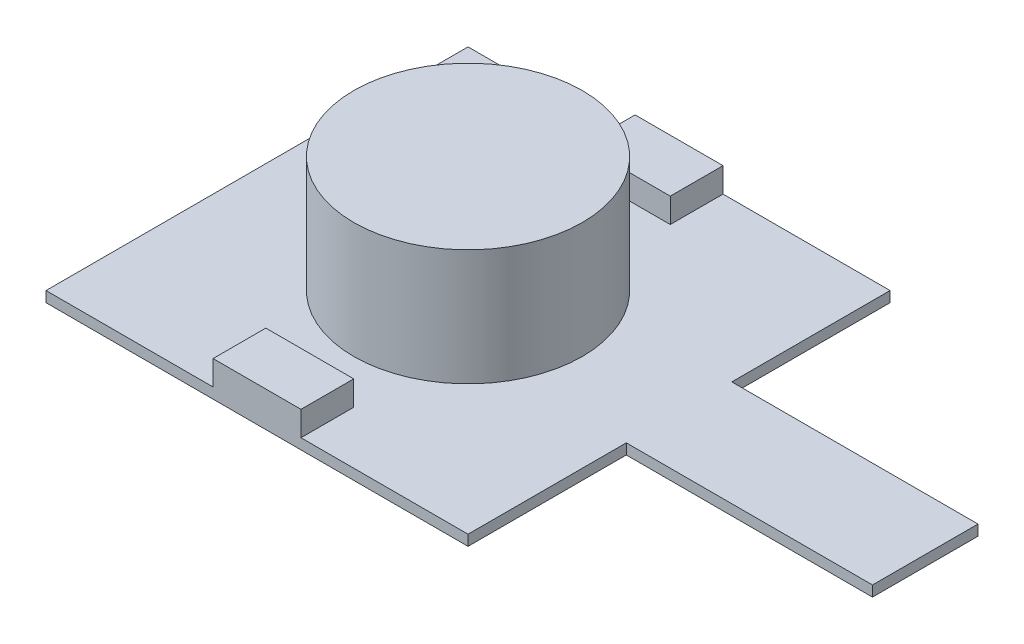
ISO-10303-21;
HEADER;
FILE_DESCRIPTION(('STEP AP214'),'2;1');
FILE_NAME('part.step','',(''),(''),'','','');
FILE_SCHEMA(('AUTOMOTIVE_DESIGN { 1 0 10303 214 1 1 1 1 }'));
ENDSEC;
DATA;
#1=APPLICATION_CONTEXT('core data for automotive mechanical design processes');
#2=APPLICATION_PROTOCOL_DEFINITION('international standard','automotive_design',2000,#1);
#3=PRODUCT_CONTEXT('',#1,'mechanical');
#4=PRODUCT('Part','Part','',(#3));
#5=PRODUCT_RELATED_PRODUCT_CATEGORY('part','',(#4));
#6=PRODUCT_DEFINITION_FORMATION('','',#4);
#7=PRODUCT_DEFINITION_CONTEXT('part definition',#1,'design');
#8=PRODUCT_DEFINITION('design','',#6,#7);
#9=PRODUCT_DEFINITION_SHAPE('','',#8);
#10=(LENGTH_UNIT() NAMED_UNIT(*) SI_UNIT(.MILLI.,.METRE.));
#11=(NAMED_UNIT(*) PLANE_ANGLE_UNIT() SI_UNIT($,.RADIAN.));
#12=(NAMED_UNIT(*) SI_UNIT($,.STERADIAN.) SOLID_ANGLE_UNIT());
#13=UNCERTAINTY_MEASURE_WITH_UNIT(LENGTH_MEASURE(1.E-05),#10,'distance_accuracy_value','');
#14=(GEOMETRIC_REPRESENTATION_CONTEXT(3) GLOBAL_UNCERTAINTY_ASSIGNED_CONTEXT((#13)) GLOBAL_UNIT_ASSIGNED_CONTEXT((#10,
#11,#12)) REPRESENTATION_CONTEXT('',''));
#15=CARTESIAN_POINT('',(0.,0.,0.));
#16=DIRECTION('',(0.,0.,1.));
#17=DIRECTION('',(1.,0.,0.));
#18=AXIS2_PLACEMENT_3D('',#15,#16,#17);
#19=CARTESIAN_POINT('',(0.,0.3,0.));
#20=DIRECTION('',(-1.,0.,0.));
#21=DIRECTION('',(0.,0.,1.));
#22=AXIS2_PLACEMENT_3D('',#19,#20,#21);
#23=PLANE('',#22);
#24=DIRECTION('',(0.,0.,-1.));
#25=VECTOR('',#24,1.);
#26=CARTESIAN_POINT('',(0.,0.,0.));
#27=LINE('',#26,#25);
#28=CARTESIAN_POINT('',(0.,0.,0.));
#29=VERTEX_POINT('',#28);
#30=CARTESIAN_POINT('',(0.,0.,-12.));
#31=VERTEX_POINT('',#30);
#32=EDGE_CURVE('E202',#29,#31,#27,.T.);
#33=ORIENTED_EDGE('',*,*,#32,.F.);
#34=DIRECTION('',(0.,-1.,0.));
#35=VECTOR('',#34,1.);
#36=CARTESIAN_POINT('',(0.,0.3,0.));
#37=LINE('',#36,#35);
#38=CARTESIAN_POINT('',(0.,0.3,0.));
#39=VERTEX_POINT('',#38);
#40=EDGE_CURVE('E51',#39,#29,#37,.T.);
#41=ORIENTED_EDGE('',*,*,#40,.F.);
#42=DIRECTION('',(0.,0.,-1.));
#43=VECTOR('',#42,1.);
#44=CARTESIAN_POINT('',(0.,0.3,0.));
#45=LINE('',#44,#43);
#46=CARTESIAN_POINT('',(0.,0.3,-12.));
#47=VERTEX_POINT('',#46);
#48=EDGE_CURVE('E171',#39,#47,#45,.T.);
#49=ORIENTED_EDGE('',*,*,#48,.T.);
#50=DIRECTION('',(0.,-1.,0.));
#51=VECTOR('',#50,1.);
#52=CARTESIAN_POINT('',(0.,0.3,-12.));
#53=LINE('',#52,#51);
#54=EDGE_CURVE('E11',#47,#31,#53,.T.);
#55=ORIENTED_EDGE('',*,*,#54,.T.);
#56=EDGE_LOOP('',(#33,#41,#49,#55));
#57=FACE_BOUND('',#56,.T.);
#58=ADVANCED_FACE('F43',(#57),#23,.T.);
#59=CARTESIAN_POINT('',(0.,0.3,0.));
#60=DIRECTION('',(0.,0.,-1.));
#61=DIRECTION('',(-1.,0.,0.));
#62=AXIS2_PLACEMENT_3D('',#59,#60,#61);
#63=PLANE('',#62);
#64=DIRECTION('',(1.,0.,0.));
#65=VECTOR('',#64,1.);
#66=CARTESIAN_POINT('',(0.,0.,0.));
#67=LINE('',#66,#65);
#68=CARTESIAN_POINT('',(12.,0.,0.));
#69=VERTEX_POINT('',#68);
#70=EDGE_CURVE('E205',#29,#69,#67,.T.);
#71=ORIENTED_EDGE('',*,*,#70,.T.);
#72=DIRECTION('',(0.,-1.,0.));
#73=VECTOR('',#72,1.);
#74=CARTESIAN_POINT('',(12.,0.3,0.));
#75=LINE('',#74,#73);
#76=CARTESIAN_POINT('',(12.,0.3,0.));
#77=VERTEX_POINT('',#76);
#78=EDGE_CURVE('E230',#77,#69,#75,.T.);
#79=ORIENTED_EDGE('',*,*,#78,.F.);
#80=DIRECTION('',(1.,0.,0.));
#81=VECTOR('',#80,1.);
#82=CARTESIAN_POINT('',(0.,0.3,0.));
#83=LINE('',#82,#81);
#84=CARTESIAN_POINT('',(7.25,0.3,0.));
#85=VERTEX_POINT('',#84);
#86=EDGE_CURVE('E178',#85,#77,#83,.T.);
#87=ORIENTED_EDGE('',*,*,#86,.F.);
#88=DIRECTION('',(0.,-1.,0.));
#89=VECTOR('',#88,1.);
#90=CARTESIAN_POINT('',(7.25,1.,0.));
#91=LINE('',#90,#89);
#92=CARTESIAN_POINT('',(7.25,1.,0.));
#93=VERTEX_POINT('',#92);
#94=EDGE_CURVE('E254',#93,#85,#91,.T.);
#95=ORIENTED_EDGE('',*,*,#94,.F.);
#96=DIRECTION('',(1.,0.,0.));
#97=VECTOR('',#96,1.);
#98=CARTESIAN_POINT('',(0.,1.,0.));
#99=LINE('',#98,#97);
#100=CARTESIAN_POINT('',(4.75,1.,0.));
#101=VERTEX_POINT('',#100);
#102=EDGE_CURVE('E362',#101,#93,#99,.T.);
#103=ORIENTED_EDGE('',*,*,#102,.F.);
#104=DIRECTION('',(0.,-1.,0.));
#105=VECTOR('',#104,1.);
#106=CARTESIAN_POINT('',(4.75,1.,0.));
#107=LINE('',#106,#105);
#108=CARTESIAN_POINT('',(4.75,0.3,0.));
#109=VERTEX_POINT('',#108);
#110=EDGE_CURVE('E206',#101,#109,#107,.T.);
#111=ORIENTED_EDGE('',*,*,#110,.T.);
#112=EDGE_CURVE('E174',#39,#109,#83,.T.);
#113=ORIENTED_EDGE('',*,*,#112,.F.);
#114=ORIENTED_EDGE('',*,*,#40,.T.);
#115=EDGE_LOOP('',(#71,#79,#87,#95,#103,#111,#113,#114));
#116=FACE_BOUND('',#115,.T.);
#117=ADVANCED_FACE('F236',(#116),#63,.F.);
#118=CARTESIAN_POINT('',(12.,0.3,0.));
#119=DIRECTION('',(-1.,0.,0.));
#120=DIRECTION('',(0.,0.,1.));
#121=AXIS2_PLACEMENT_3D('',#118,#119,#120);
#122=PLANE('',#121);
#123=DIRECTION('',(0.,0.,-1.));
#124=VECTOR('',#123,1.);
#125=CARTESIAN_POINT('',(12.,0.,0.));
#126=LINE('',#125,#124);
#127=CARTESIAN_POINT('',(12.,0.,-4.5));
#128=VERTEX_POINT('',#127);
#129=EDGE_CURVE('E209',#69,#128,#126,.T.);
#130=ORIENTED_EDGE('',*,*,#129,.T.);
#131=DIRECTION('',(0.,-1.,0.));
#132=VECTOR('',#131,1.);
#133=CARTESIAN_POINT('',(12.,0.3,-4.5));
#134=LINE('',#133,#132);
#135=CARTESIAN_POINT('',(12.,0.3,-4.5));
#136=VERTEX_POINT('',#135);
#137=EDGE_CURVE('E227',#136,#128,#134,.T.);
#138=ORIENTED_EDGE('',*,*,#137,.F.);
#139=DIRECTION('',(0.,0.,-1.));
#140=VECTOR('',#139,1.);
#141=CARTESIAN_POINT('',(12.,0.3,0.));
#142=LINE('',#141,#140);
#143=EDGE_CURVE('E187',#77,#136,#142,.T.);
#144=ORIENTED_EDGE('',*,*,#143,.F.);
#145=ORIENTED_EDGE('',*,*,#78,.T.);
#146=EDGE_LOOP('',(#130,#138,#144,#145));
#147=FACE_BOUND('',#146,.T.);
#148=ADVANCED_FACE('F245',(#147),#122,.F.);
#149=CARTESIAN_POINT('',(0.,0.3,-4.5));
#150=DIRECTION('',(0.,0.,-1.));
#151=DIRECTION('',(-1.,0.,0.));
#152=AXIS2_PLACEMENT_3D('',#149,#150,#151);
#153=PLANE('',#152);
#154=DIRECTION('',(1.,0.,0.));
#155=VECTOR('',#154,1.);
#156=CARTESIAN_POINT('',(0.,0.,-4.5));
#157=LINE('',#156,#155);
#158=CARTESIAN_POINT('',(19.,0.,-4.5));
#159=VERTEX_POINT('',#158);
#160=EDGE_CURVE('E212',#128,#159,#157,.T.);
#161=ORIENTED_EDGE('',*,*,#160,.T.);
#162=DIRECTION('',(0.,-1.,0.));
#163=VECTOR('',#162,1.);
#164=CARTESIAN_POINT('',(19.,0.3,-4.5));
#165=LINE('',#164,#163);
#166=CARTESIAN_POINT('',(19.,0.3,-4.5));
#167=VERTEX_POINT('',#166);
#168=EDGE_CURVE('E225',#167,#159,#165,.T.);
#169=ORIENTED_EDGE('',*,*,#168,.F.);
#170=DIRECTION('',(1.,0.,0.));
#171=VECTOR('',#170,1.);
#172=CARTESIAN_POINT('',(0.,0.3,-4.5));
#173=LINE('',#172,#171);
#174=EDGE_CURVE('E190',#136,#167,#173,.T.);
#175=ORIENTED_EDGE('',*,*,#174,.F.);
#176=ORIENTED_EDGE('',*,*,#137,.T.);
#177=EDGE_LOOP('',(#161,#169,#175,#176));
#178=FACE_BOUND('',#177,.T.);
#179=ADVANCED_FACE('F329',(#178),#153,.F.);
#180=CARTESIAN_POINT('',(19.,0.3,0.));
#181=DIRECTION('',(1.,0.,0.));
#182=DIRECTION('',(0.,0.,-1.));
#183=AXIS2_PLACEMENT_3D('',#180,#181,#182);
#184=PLANE('',#183);
#185=DIRECTION('',(0.,0.,1.));
#186=VECTOR('',#185,1.);
#187=CARTESIAN_POINT('',(19.,0.,0.));
#188=LINE('',#187,#186);
#189=CARTESIAN_POINT('',(19.,0.,-7.5));
#190=VERTEX_POINT('',#189);
#191=EDGE_CURVE('E215',#190,#159,#188,.T.);
#192=ORIENTED_EDGE('',*,*,#191,.F.);
#193=DIRECTION('',(0.,-1.,0.));
#194=VECTOR('',#193,1.);
#195=CARTESIAN_POINT('',(19.,0.3,-7.5));
#196=LINE('',#195,#194);
#197=CARTESIAN_POINT('',(19.,0.3,-7.5));
#198=VERTEX_POINT('',#197);
#199=EDGE_CURVE('E223',#198,#190,#196,.T.);
#200=ORIENTED_EDGE('',*,*,#199,.F.);
#201=DIRECTION('',(0.,0.,1.));
#202=VECTOR('',#201,1.);
#203=CARTESIAN_POINT('',(19.,0.3,0.));
#204=LINE('',#203,#202);
#205=EDGE_CURVE('E192',#198,#167,#204,.T.);
#206=ORIENTED_EDGE('',*,*,#205,.T.);
#207=ORIENTED_EDGE('',*,*,#168,.T.);
#208=EDGE_LOOP('',(#192,#200,#206,#207));
#209=FACE_BOUND('',#208,.T.);
#210=ADVANCED_FACE('F335',(#209),#184,.T.);
#211=CARTESIAN_POINT('',(0.,0.3,-7.5));
#212=DIRECTION('',(0.,0.,-1.));
#213=DIRECTION('',(-1.,0.,0.));
#214=AXIS2_PLACEMENT_3D('',#211,#212,#213);
#215=PLANE('',#214);
#216=DIRECTION('',(1.,0.,0.));
#217=VECTOR('',#216,1.);
#218=CARTESIAN_POINT('',(0.,0.,-7.5));
#219=LINE('',#218,#217);
#220=CARTESIAN_POINT('',(12.,0.,-7.5));
#221=VERTEX_POINT('',#220);
#222=EDGE_CURVE('E218',#221,#190,#219,.T.);
#223=ORIENTED_EDGE('',*,*,#222,.F.);
#224=DIRECTION('',(0.,-1.,0.));
#225=VECTOR('',#224,1.);
#226=CARTESIAN_POINT('',(12.,0.3,-7.5));
#227=LINE('',#226,#225);
#228=CARTESIAN_POINT('',(12.,0.3,-7.5));
#229=VERTEX_POINT('',#228);
#230=EDGE_CURVE('E89',#229,#221,#227,.T.);
#231=ORIENTED_EDGE('',*,*,#230,.F.);
#232=DIRECTION('',(1.,0.,0.));
#233=VECTOR('',#232,1.);
#234=CARTESIAN_POINT('',(0.,0.3,-7.5));
#235=LINE('',#234,#233);
#236=EDGE_CURVE('E195',#229,#198,#235,.T.);
#237=ORIENTED_EDGE('',*,*,#236,.T.);
#238=ORIENTED_EDGE('',*,*,#199,.T.);
#239=EDGE_LOOP('',(#223,#231,#237,#238));
#240=FACE_BOUND('',#239,.T.);
#241=ADVANCED_FACE('F339',(#240),#215,.T.);
#242=CARTESIAN_POINT('',(12.,0.,-12.));
#243=VERTEX_POINT('',#242);
#244=EDGE_CURVE('E201',#221,#243,#126,.T.);
#245=ORIENTED_EDGE('',*,*,#244,.T.);
#246=DIRECTION('',(0.,-1.,0.));
#247=VECTOR('',#246,1.);
#248=CARTESIAN_POINT('',(12.,0.3,-12.));
#249=LINE('',#248,#247);
#250=CARTESIAN_POINT('',(12.,0.3,-12.));
#251=VERTEX_POINT('',#250);
#252=EDGE_CURVE('E96',#251,#243,#249,.T.);
#253=ORIENTED_EDGE('',*,*,#252,.F.);
#254=EDGE_CURVE('E132',#229,#251,#142,.T.);
#255=ORIENTED_EDGE('',*,*,#254,.F.);
#256=ORIENTED_EDGE('',*,*,#230,.T.);
#257=EDGE_LOOP('',(#245,#253,#255,#256));
#258=FACE_BOUND('',#257,.T.);
#259=ADVANCED_FACE('F331',(#258),#122,.F.);
#260=CARTESIAN_POINT('',(0.,0.3,-12.));
#261=DIRECTION('',(0.,0.,-1.));
#262=DIRECTION('',(-1.,0.,0.));
#263=AXIS2_PLACEMENT_3D('',#260,#261,#262);
#264=PLANE('',#263);
#265=DIRECTION('',(1.,0.,0.));
#266=VECTOR('',#265,1.);
#267=CARTESIAN_POINT('',(0.,0.,-12.));
#268=LINE('',#267,#266);
#269=EDGE_CURVE('E169',#31,#243,#268,.T.);
#270=ORIENTED_EDGE('',*,*,#269,.F.);
#271=ORIENTED_EDGE('',*,*,#54,.F.);
#272=DIRECTION('',(1.,0.,0.));
#273=VECTOR('',#272,1.);
#274=CARTESIAN_POINT('',(0.,0.3,-12.));
#275=LINE('',#274,#273);
#276=CARTESIAN_POINT('',(4.75,0.3,-12.));
#277=VERTEX_POINT('',#276);
#278=EDGE_CURVE('E135',#47,#277,#275,.T.);
#279=ORIENTED_EDGE('',*,*,#278,.T.);
#280=DIRECTION('',(0.,-1.,0.));
#281=VECTOR('',#280,1.);
#282=CARTESIAN_POINT('',(4.75,1.,-12.));
#283=LINE('',#282,#281);
#284=CARTESIAN_POINT('',(4.75,1.,-12.));
#285=VERTEX_POINT('',#284);
#286=EDGE_CURVE('E162',#285,#277,#283,.T.);
#287=ORIENTED_EDGE('',*,*,#286,.F.);
#288=DIRECTION('',(1.,0.,0.));
#289=VECTOR('',#288,1.);
#290=CARTESIAN_POINT('',(0.,1.,-12.));
#291=LINE('',#290,#289);
#292=CARTESIAN_POINT('',(7.25,1.,-12.));
#293=VERTEX_POINT('',#292);
#294=EDGE_CURVE('E150',#285,#293,#291,.T.);
#295=ORIENTED_EDGE('',*,*,#294,.T.);
#296=DIRECTION('',(0.,-1.,0.));
#297=VECTOR('',#296,1.);
#298=CARTESIAN_POINT('',(7.25,1.,-12.));
#299=LINE('',#298,#297);
#300=CARTESIAN_POINT('',(7.25,0.3,-12.));
#301=VERTEX_POINT('',#300);
#302=EDGE_CURVE('E142',#293,#301,#299,.T.);
#303=ORIENTED_EDGE('',*,*,#302,.T.);
#304=EDGE_CURVE('E127',#301,#251,#275,.T.);
#305=ORIENTED_EDGE('',*,*,#304,.T.);
#306=ORIENTED_EDGE('',*,*,#252,.T.);
#307=EDGE_LOOP('',(#270,#271,#279,#287,#295,#303,#305,#306));
#308=FACE_BOUND('',#307,.T.);
#309=ADVANCED_FACE('F147',(#308),#264,.T.);
#310=CARTESIAN_POINT('',(0.,0.3,0.));
#311=DIRECTION('',(0.,1.,0.));
#312=DIRECTION('',(0.,0.,1.));
#313=AXIS2_PLACEMENT_3D('',#310,#311,#312);
#314=PLANE('',#313);
#315=CARTESIAN_POINT('',(6.,0.3,-6.));
#316=DIRECTION('',(0.,1.,0.));
#317=DIRECTION('',(0.,0.,1.));
#318=AXIS2_PLACEMENT_3D('',#315,#316,#317);
#319=CIRCLE('',#318,3.25);
#320=CARTESIAN_POINT('',(6.,0.3,-2.75));
#321=VERTEX_POINT('',#320);
#322=EDGE_CURVE('E166',#321,#321,#319,.T.);
#323=ORIENTED_EDGE('',*,*,#322,.F.);
#324=EDGE_LOOP('',(#323));
#325=FACE_BOUND('',#324,.T.);
#326=DIRECTION('',(0.,0.,1.));
#327=VECTOR('',#326,1.);
#328=CARTESIAN_POINT('',(4.74999999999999,0.3,0.));
#329=LINE('',#328,#327);
#330=CARTESIAN_POINT('',(4.75,0.3,-10.5));
#331=VERTEX_POINT('',#330);
#332=EDGE_CURVE('E100',#277,#331,#329,.T.);
#333=ORIENTED_EDGE('',*,*,#332,.F.);
#334=ORIENTED_EDGE('',*,*,#278,.F.);
#335=ORIENTED_EDGE('',*,*,#48,.F.);
#336=ORIENTED_EDGE('',*,*,#112,.T.);
#337=DIRECTION('',(0.,0.,-1.));
#338=VECTOR('',#337,1.);
#339=CARTESIAN_POINT('',(4.75,0.3,0.));
#340=LINE('',#339,#338);
#341=CARTESIAN_POINT('',(4.75,0.3,-1.5));
#342=VERTEX_POINT('',#341);
#343=EDGE_CURVE('E177',#109,#342,#340,.T.);
#344=ORIENTED_EDGE('',*,*,#343,.T.);
#345=DIRECTION('',(-1.,0.,0.));
#346=VECTOR('',#345,1.);
#347=CARTESIAN_POINT('',(0.,0.3,-1.5));
#348=LINE('',#347,#346);
#349=CARTESIAN_POINT('',(7.25,0.3,-1.5));
#350=VERTEX_POINT('',#349);
#351=EDGE_CURVE('E181',#350,#342,#348,.T.);
#352=ORIENTED_EDGE('',*,*,#351,.F.);
#353=DIRECTION('',(0.,0.,-1.));
#354=VECTOR('',#353,1.);
#355=CARTESIAN_POINT('',(7.25,0.3,0.));
#356=LINE('',#355,#354);
#357=EDGE_CURVE('E184',#85,#350,#356,.T.);
#358=ORIENTED_EDGE('',*,*,#357,.F.);
#359=ORIENTED_EDGE('',*,*,#86,.T.);
#360=ORIENTED_EDGE('',*,*,#143,.T.);
#361=ORIENTED_EDGE('',*,*,#174,.T.);
#362=ORIENTED_EDGE('',*,*,#205,.F.);
#363=ORIENTED_EDGE('',*,*,#236,.F.);
#364=ORIENTED_EDGE('',*,*,#254,.T.);
#365=ORIENTED_EDGE('',*,*,#304,.F.);
#366=DIRECTION('',(0.,0.,1.));
#367=VECTOR('',#366,1.);
#368=CARTESIAN_POINT('',(7.25000000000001,0.3,0.));
#369=LINE('',#368,#367);
#370=CARTESIAN_POINT('',(7.25,0.3,-10.5));
#371=VERTEX_POINT('',#370);
#372=EDGE_CURVE('E130',#301,#371,#369,.T.);
#373=ORIENTED_EDGE('',*,*,#372,.T.);
#374=DIRECTION('',(-1.,0.,0.));
#375=VECTOR('',#374,1.);
#376=CARTESIAN_POINT('',(0.,0.3,-10.5));
#377=LINE('',#376,#375);
#378=EDGE_CURVE('E59',#371,#331,#377,.T.);
#379=ORIENTED_EDGE('',*,*,#378,.T.);
#380=EDGE_LOOP('',(#333,#334,#335,#336,#344,#352,#358,#359,#360,#361,#362,#363,#364,#365,#373,#379));
#381=FACE_BOUND('',#380,.T.);
#382=ADVANCED_FACE('F129',(#325,#381),#314,.T.);
#383=CARTESIAN_POINT('',(0.,0.,0.));
#384=DIRECTION('',(0.,1.,0.));
#385=DIRECTION('',(0.,0.,1.));
#386=AXIS2_PLACEMENT_3D('',#383,#384,#385);
#387=PLANE('',#386);
#388=ORIENTED_EDGE('',*,*,#32,.T.);
#389=ORIENTED_EDGE('',*,*,#269,.T.);
#390=ORIENTED_EDGE('',*,*,#244,.F.);
#391=ORIENTED_EDGE('',*,*,#222,.T.);
#392=ORIENTED_EDGE('',*,*,#191,.T.);
#393=ORIENTED_EDGE('',*,*,#160,.F.);
#394=ORIENTED_EDGE('',*,*,#129,.F.);
#395=ORIENTED_EDGE('',*,*,#70,.F.);
#396=EDGE_LOOP('',(#388,#389,#390,#391,#392,#393,#394,#395));
#397=FACE_BOUND('',#396,.T.);
#398=ADVANCED_FACE('F242',(#397),#387,.F.);
#399=CARTESIAN_POINT('',(4.74999999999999,1.,0.));
#400=DIRECTION('',(1.,0.,0.));
#401=DIRECTION('',(0.,0.,-1.));
#402=AXIS2_PLACEMENT_3D('',#399,#400,#401);
#403=PLANE('',#402);
#404=ORIENTED_EDGE('',*,*,#332,.T.);
#405=DIRECTION('',(0.,-1.,0.));
#406=VECTOR('',#405,1.);
#407=CARTESIAN_POINT('',(4.75,1.,-10.5));
#408=LINE('',#407,#406);
#409=CARTESIAN_POINT('',(4.75,1.,-10.5));
#410=VERTEX_POINT('',#409);
#411=EDGE_CURVE('E154',#410,#331,#408,.T.);
#412=ORIENTED_EDGE('',*,*,#411,.F.);
#413=DIRECTION('',(0.,0.,1.));
#414=VECTOR('',#413,1.);
#415=CARTESIAN_POINT('',(4.74999999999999,1.,0.));
#416=LINE('',#415,#414);
#417=EDGE_CURVE('E281',#285,#410,#416,.T.);
#418=ORIENTED_EDGE('',*,*,#417,.F.);
#419=ORIENTED_EDGE('',*,*,#286,.T.);
#420=EDGE_LOOP('',(#404,#412,#418,#419));
#421=FACE_BOUND('',#420,.T.);
#422=ADVANCED_FACE('F309',(#421),#403,.F.);
#423=CARTESIAN_POINT('',(0.,1.,-10.5));
#424=DIRECTION('',(0.,0.,1.));
#425=DIRECTION('',(1.,0.,0.));
#426=AXIS2_PLACEMENT_3D('',#423,#424,#425);
#427=PLANE('',#426);
#428=ORIENTED_EDGE('',*,*,#411,.T.);
#429=ORIENTED_EDGE('',*,*,#378,.F.);
#430=DIRECTION('',(0.,-1.,0.));
#431=VECTOR('',#430,1.);
#432=CARTESIAN_POINT('',(7.25,1.,-10.5));
#433=LINE('',#432,#431);
#434=CARTESIAN_POINT('',(7.25,1.,-10.5));
#435=VERTEX_POINT('',#434);
#436=EDGE_CURVE('E145',#435,#371,#433,.T.);
#437=ORIENTED_EDGE('',*,*,#436,.F.);
#438=DIRECTION('',(-1.,0.,0.));
#439=VECTOR('',#438,1.);
#440=CARTESIAN_POINT('',(0.,1.,-10.5));
#441=LINE('',#440,#439);
#442=EDGE_CURVE('E156',#435,#410,#441,.T.);
#443=ORIENTED_EDGE('',*,*,#442,.T.);
#444=EDGE_LOOP('',(#428,#429,#437,#443));
#445=FACE_BOUND('',#444,.T.);
#446=ADVANCED_FACE('F288',(#445),#427,.T.);
#447=CARTESIAN_POINT('',(7.25000000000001,1.,0.));
#448=DIRECTION('',(1.,0.,0.));
#449=DIRECTION('',(0.,0.,-1.));
#450=AXIS2_PLACEMENT_3D('',#447,#448,#449);
#451=PLANE('',#450);
#452=ORIENTED_EDGE('',*,*,#436,.T.);
#453=ORIENTED_EDGE('',*,*,#372,.F.);
#454=ORIENTED_EDGE('',*,*,#302,.F.);
#455=DIRECTION('',(0.,0.,1.));
#456=VECTOR('',#455,1.);
#457=CARTESIAN_POINT('',(7.25000000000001,1.,0.));
#458=LINE('',#457,#456);
#459=EDGE_CURVE('E152',#293,#435,#458,.T.);
#460=ORIENTED_EDGE('',*,*,#459,.T.);
#461=EDGE_LOOP('',(#452,#453,#454,#460));
#462=FACE_BOUND('',#461,.T.);
#463=ADVANCED_FACE('F139',(#462),#451,.T.);
#464=CARTESIAN_POINT('',(0.,1.,0.));
#465=DIRECTION('',(0.,1.,0.));
#466=DIRECTION('',(0.,0.,1.));
#467=AXIS2_PLACEMENT_3D('',#464,#465,#466);
#468=PLANE('',#467);
#469=ORIENTED_EDGE('',*,*,#294,.F.);
#470=ORIENTED_EDGE('',*,*,#417,.T.);
#471=ORIENTED_EDGE('',*,*,#442,.F.);
#472=ORIENTED_EDGE('',*,*,#459,.F.);
#473=EDGE_LOOP('',(#469,#470,#471,#472));
#474=FACE_BOUND('',#473,.T.);
#475=ADVANCED_FACE('F294',(#474),#468,.T.);
#476=CARTESIAN_POINT('',(4.75,1.,0.));
#477=DIRECTION('',(-1.,0.,0.));
#478=DIRECTION('',(0.,0.,1.));
#479=AXIS2_PLACEMENT_3D('',#476,#477,#478);
#480=PLANE('',#479);
#481=DIRECTION('',(0.,-1.,0.));
#482=VECTOR('',#481,1.);
#483=CARTESIAN_POINT('',(4.75,1.,-1.5));
#484=LINE('',#483,#482);
#485=CARTESIAN_POINT('',(4.75,1.,-1.5));
#486=VERTEX_POINT('',#485);
#487=EDGE_CURVE('E273',#486,#342,#484,.T.);
#488=ORIENTED_EDGE('',*,*,#487,.T.);
#489=ORIENTED_EDGE('',*,*,#343,.F.);
#490=ORIENTED_EDGE('',*,*,#110,.F.);
#491=DIRECTION('',(0.,0.,-1.));
#492=VECTOR('',#491,1.);
#493=CARTESIAN_POINT('',(4.75,1.,0.));
#494=LINE('',#493,#492);
#495=EDGE_CURVE('E165',#101,#486,#494,.T.);
#496=ORIENTED_EDGE('',*,*,#495,.T.);
#497=EDGE_LOOP('',(#488,#489,#490,#496));
#498=FACE_BOUND('',#497,.T.);
#499=ADVANCED_FACE('F370',(#498),#480,.T.);
#500=CARTESIAN_POINT('',(7.25,1.,0.));
#501=DIRECTION('',(-1.,0.,0.));
#502=DIRECTION('',(0.,0.,1.));
#503=AXIS2_PLACEMENT_3D('',#500,#501,#502);
#504=PLANE('',#503);
#505=ORIENTED_EDGE('',*,*,#357,.T.);
#506=DIRECTION('',(0.,-1.,0.));
#507=VECTOR('',#506,1.);
#508=CARTESIAN_POINT('',(7.25,1.,-1.5));
#509=LINE('',#508,#507);
#510=CARTESIAN_POINT('',(7.25,1.,-1.5));
#511=VERTEX_POINT('',#510);
#512=EDGE_CURVE('E263',#511,#350,#509,.T.);
#513=ORIENTED_EDGE('',*,*,#512,.F.);
#514=DIRECTION('',(0.,0.,-1.));
#515=VECTOR('',#514,1.);
#516=CARTESIAN_POINT('',(7.25,1.,0.));
#517=LINE('',#516,#515);
#518=EDGE_CURVE('E365',#93,#511,#517,.T.);
#519=ORIENTED_EDGE('',*,*,#518,.F.);
#520=ORIENTED_EDGE('',*,*,#94,.T.);
#521=EDGE_LOOP('',(#505,#513,#519,#520));
#522=FACE_BOUND('',#521,.T.);
#523=ADVANCED_FACE('F261',(#522),#504,.F.);
#524=CARTESIAN_POINT('',(0.,1.,-1.5));
#525=DIRECTION('',(0.,0.,1.));
#526=DIRECTION('',(1.,0.,0.));
#527=AXIS2_PLACEMENT_3D('',#524,#525,#526);
#528=PLANE('',#527);
#529=ORIENTED_EDGE('',*,*,#351,.T.);
#530=ORIENTED_EDGE('',*,*,#487,.F.);
#531=DIRECTION('',(-1.,0.,0.));
#532=VECTOR('',#531,1.);
#533=CARTESIAN_POINT('',(0.,1.,-1.5));
#534=LINE('',#533,#532);
#535=EDGE_CURVE('E272',#511,#486,#534,.T.);
#536=ORIENTED_EDGE('',*,*,#535,.F.);
#537=ORIENTED_EDGE('',*,*,#512,.T.);
#538=EDGE_LOOP('',(#529,#530,#536,#537));
#539=FACE_BOUND('',#538,.T.);
#540=ADVANCED_FACE('F268',(#539),#528,.F.);
#541=CARTESIAN_POINT('',(0.,1.,0.));
#542=DIRECTION('',(0.,1.,0.));
#543=DIRECTION('',(0.,0.,1.));
#544=AXIS2_PLACEMENT_3D('',#541,#542,#543);
#545=PLANE('',#544);
#546=ORIENTED_EDGE('',*,*,#495,.F.);
#547=ORIENTED_EDGE('',*,*,#102,.T.);
#548=ORIENTED_EDGE('',*,*,#518,.T.);
#549=ORIENTED_EDGE('',*,*,#535,.T.);
#550=EDGE_LOOP('',(#546,#547,#548,#549));
#551=FACE_BOUND('',#550,.T.);
#552=ADVANCED_FACE('F353',(#551),#545,.T.);
#553=CARTESIAN_POINT('',(6.,3.6,-6.));
#554=DIRECTION('',(0.,-1.,0.));
#555=DIRECTION('',(0.,0.,-1.));
#556=AXIS2_PLACEMENT_3D('',#553,#554,#555);
#557=CYLINDRICAL_SURFACE('',#556,3.25);
#558=ORIENTED_EDGE('',*,*,#322,.T.);
#559=EDGE_LOOP('',(#558));
#560=FACE_BOUND('',#559,.T.);
#561=CARTESIAN_POINT('',(6.,3.6,-6.));
#562=DIRECTION('',(0.,1.,0.));
#563=DIRECTION('',(0.,0.,1.));
#564=AXIS2_PLACEMENT_3D('',#561,#562,#563);
#565=CIRCLE('',#564,3.25);
#566=CARTESIAN_POINT('',(6.,3.6,-2.75));
#567=VERTEX_POINT('',#566);
#568=EDGE_CURVE('E282',#567,#567,#565,.T.);
#569=ORIENTED_EDGE('',*,*,#568,.F.);
#570=EDGE_LOOP('',(#569));
#571=FACE_BOUND('',#570,.T.);
#572=ADVANCED_FACE('F349',(#560,#571),#557,.T.);
#573=CARTESIAN_POINT('',(0.,3.6,0.));
#574=DIRECTION('',(0.,1.,0.));
#575=DIRECTION('',(0.,0.,1.));
#576=AXIS2_PLACEMENT_3D('',#573,#574,#575);
#577=PLANE('',#576);
#578=ORIENTED_EDGE('',*,*,#568,.T.);
#579=EDGE_LOOP('',(#578));
#580=FACE_BOUND('',#579,.T.);
#581=ADVANCED_FACE('F352',(#580),#577,.T.);
#582=CLOSED_SHELL('',(#58,#117,#148,#179,#210,#241,#259,#309,#382,#398,#422,#446,#463,#475,#499,
#523,#540,#552,#572,#581));
#583=MANIFOLD_SOLID_BREP('B2',#582);
#584=ADVANCED_BREP_SHAPE_REPRESENTATION('',(#18,#583),#14);
#585=SHAPE_DEFINITION_REPRESENTATION(#9,#584);
ENDSEC;
END-ISO-10303-21;
